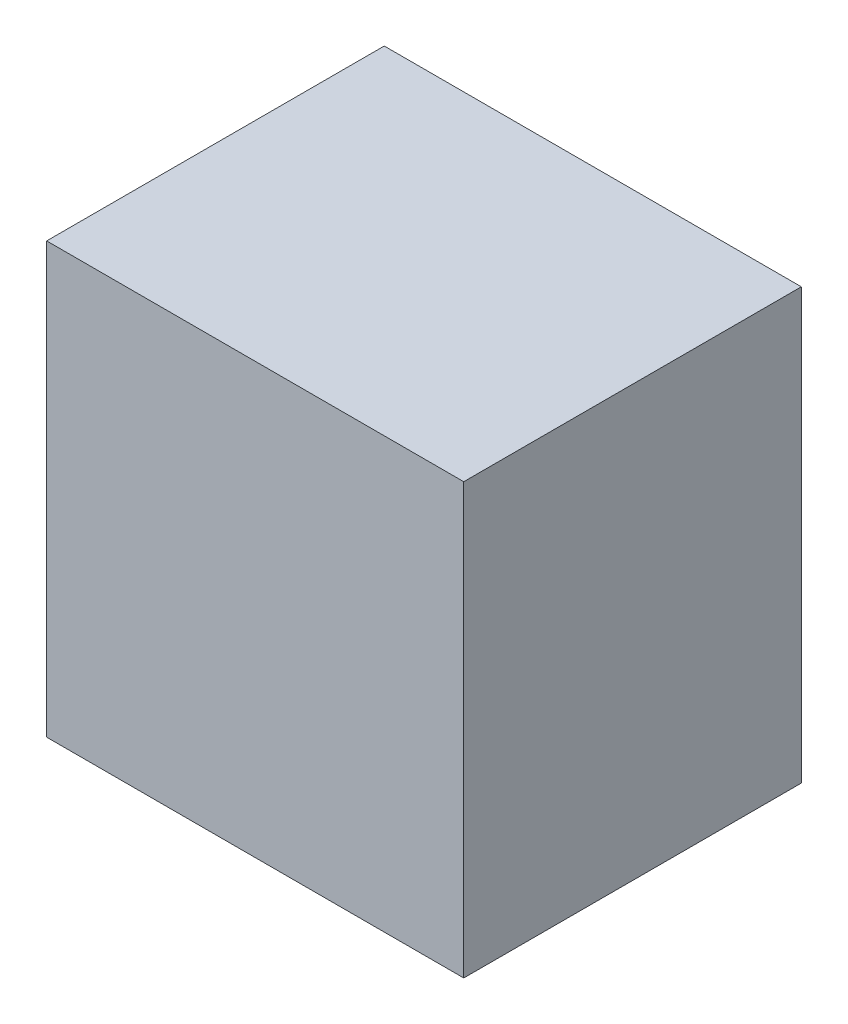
from build123d import *

# Parameters (mm, degrees)
SKETCH1_W           = 38.337165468
SKETCH1_H           = 39.50776594
BOSS_EXTRUDE3_DEPTH = 31.029790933


with BuildPart() as part:
    # Sketch1 → Boss-Extrude3 (new body)
    with BuildSketch(Plane.XY):
        Rectangle(SKETCH1_W, SKETCH1_H)
    extrude(amount=BOSS_EXTRUDE3_DEPTH)


solid = part.part
